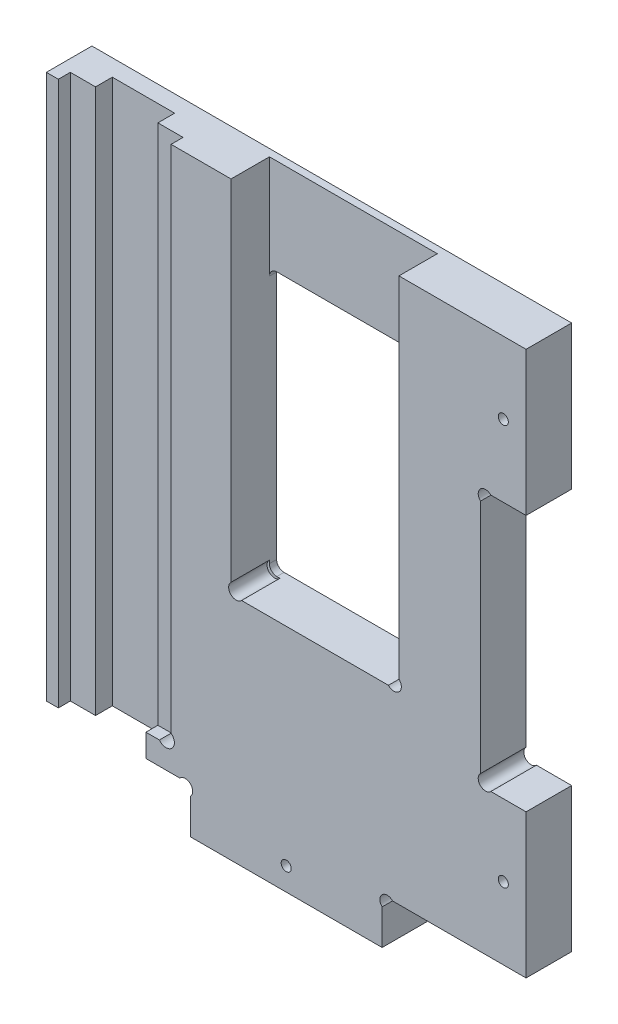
from build123d import *

# Parameters (mm, degrees)
ESQUISSE1_R             = 2.1
BOSS_EXTRU_1_DEPTH      = 19
ESQUISSE2_W             = 26
ESQUISSE2_H             = 243.772383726
ENL_V_MAT_EXTRU_1_DEPTH = 12
ESQUISSE3_W             = 17.347370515
ESQUISSE3_H             = 241.597846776
ENL_V_MAT_EXTRU_2_DEPTH = 5
ENL_V_MAT_EXTRU_3_DEPTH = 16
ENL_V_MAT_EXTRU_4_DEPTH = 753.268547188


with BuildPart() as part:
    # Esquisse1 → Boss.-Extru.1 (new body)
    with BuildSketch(Plane.XY):
        with BuildLine():
            Line((710.729179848, 246), (510.729179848, 246))
            Line((510.729179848, 246), (510.729179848, 19))
            Line((510.729179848, 19), (566.348828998, 19))
            ThreePointArc((566.348828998, 19), (570.82121087, 19.092031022), (570.729179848, 14.61964915))
            Line((570.729179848, 14.61964915), (570.729179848, 0))
            Line((570.729179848, 0), (650.729179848, 0))
            Line((650.729179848, 0), (650.729179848, 14.688100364))
            ThreePointArc((650.729179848, 14.688100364), (650.672504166, 19.056675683), (655.041079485, 19))
            Line((655.041079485, 19), (710.729179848, 19))
            Line((710.729179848, 19), (710.729179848, 79))
            Line((710.729179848, 79), (696.041079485, 79))
            ThreePointArc((696.041079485, 79), (691.672504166, 78.943324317), (691.729179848, 83.311899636))
            Line((691.729179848, 83.311899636), (691.729179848, 181.688100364))
            ThreePointArc((691.729179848, 181.688100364), (691.672504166, 186.056675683), (696.041079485, 186))
            Line((696.041079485, 186), (710.729179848, 186))
            Line((710.729179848, 186), (710.729179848, 246))
        make_face()
        with Locations((701.229179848, 216)):
            Circle(ESQUISSE1_R, mode=Mode.SUBTRACT)
        with Locations(Location((701.229179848, 49, 0), (0, 0, 180))):
            Circle(ESQUISSE1_R, mode=Mode.SUBTRACT)
        with Locations(Location((610.729179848, 9.5, 0), (0, 0, 180))):
            Circle(ESQUISSE1_R, mode=Mode.SUBTRACT)
    extrude(amount=BOSS_EXTRU_1_DEPTH)

    # Esquisse2 → Enl_v. mat.-Extru.1 (cut)
    with BuildSketch(Plane.XY.offset(19)):
        with Locations((539.229179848, 128.823228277)):
            Rectangle(ESQUISSE2_W, ESQUISSE2_H)
    extrude(amount=-ENL_V_MAT_EXTRU_1_DEPTH, mode=Mode.SUBTRACT)

    # Esquisse3 → Enl_v. mat.-Extru.2 (cut)
    with BuildSketch(Plane.XY.offset(19)):
        with BuildLine():
            Line((562.729179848, 251.308022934), (546.751161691, 251.308022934))
            Line((546.751161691, 251.308022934), (546.751161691, 28.5))
            Line((546.751161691, 28.5), (557.848828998, 28.5))
            ThreePointArc((557.848828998, 28.5), (563.092952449, 28.1362274), (562.729179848, 33.38035085))
            Line((562.729179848, 33.38035085), (562.729179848, 251.308022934))
        make_face()
        with Locations((524.402865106, 130.509099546)):
            Rectangle(ESQUISSE3_W, ESQUISSE3_H)
    extrude(amount=-ENL_V_MAT_EXTRU_2_DEPTH, mode=Mode.SUBTRACT)

    # Esquisse5 → Enl_v. mat.-Extru.3 (cut)
    with BuildSketch(Plane.XY.offset(19)):
        with BuildLine():
            Line((592.109530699, 96), (653.348828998, 96))
            ThreePointArc((653.348828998, 96), (657.82121087, 95.907968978), (657.729179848, 100.38035085))
            Line((657.729179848, 100.38035085), (657.729179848, 251.203305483))
            Line((657.729179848, 251.203305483), (587.729179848, 251.203305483))
            Line((587.729179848, 251.203305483), (587.729179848, 100.38035085))
            ThreePointArc((587.729179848, 100.38035085), (587.637148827, 95.907968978), (592.109530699, 96))
        make_face()
    extrude(amount=-ENL_V_MAT_EXTRU_3_DEPTH, mode=Mode.SUBTRACT)

    # Esquisse6 → Enl_v. mat.-Extru.4 (cut, through all)
    with BuildSketch(Plane.XY.offset(3)):
        with BuildLine():
            Line((590.829179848, 206), (654.629179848, 206))
            ThreePointArc((654.629179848, 206), (656.82121087, 205.092031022), (657.729179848, 202.9))
            Line((657.729179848, 202.9), (657.729179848, 99.1))
            ThreePointArc((657.729179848, 99.1), (656.82121087, 96.907968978), (654.629179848, 96))
            Line((654.629179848, 96), (590.829179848, 96))
            ThreePointArc((590.829179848, 96), (588.637148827, 96.907968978), (587.729179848, 99.1))
            Line((587.729179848, 99.1), (587.729179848, 202.9))
            ThreePointArc((587.729179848, 202.9), (588.637148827, 205.092031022), (590.829179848, 206))
        make_face()
    extrude(amount=-ENL_V_MAT_EXTRU_4_DEPTH, mode=Mode.SUBTRACT)


solid = part.part
